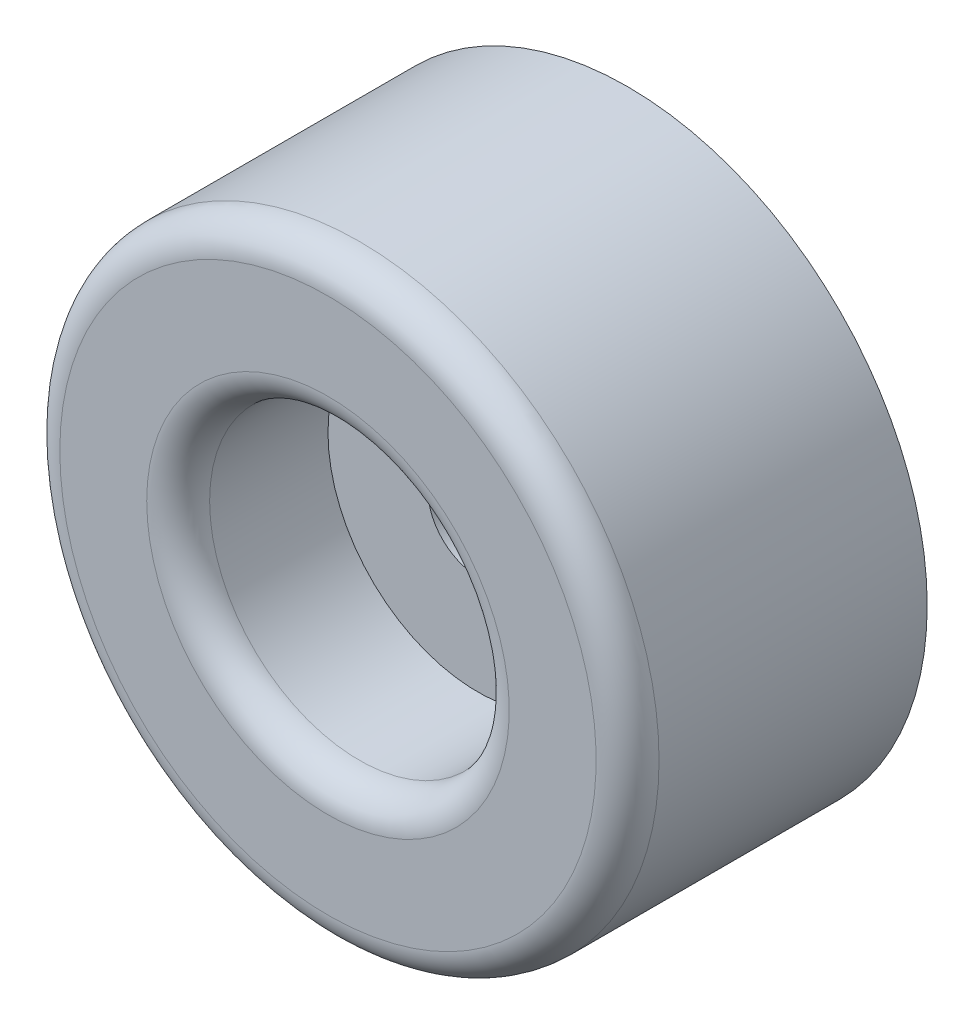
from build123d import *

# Parameters (mm, degrees)
FILLET1_R = 2


with BuildPart() as part:
    # Sketch1 → Revolve1 (revolve)
    with BuildSketch(Plane(origin=(0, 0, 0), x_dir=(0, 0, -1), z_dir=(1, 0, 0)), mode=Mode.PRIVATE) as revolve1_sk:
        Polygon((0, 3.175), (0, 19.05), (-19.05, 19.05), (-19.05, 9.525), (-9.525, 9.525), (-9.525, 3.175), align=None)
    revolve(revolve1_sk.sketch.rotate(Axis((0, 0, 13.147296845), (0, 0, -1)), 90), axis=Axis((0, 0, 13.147296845), (0, 0, -1)))

    # Fillet1
    fillet1_edges = [part.edges().sort_by_distance(p)[0] for p in [
        (-9.525, 0, 19.05),
        (-19.05, 0, 19.05),
    ]]
    fillet(fillet1_edges, radius=FILLET1_R)


solid = part.part
